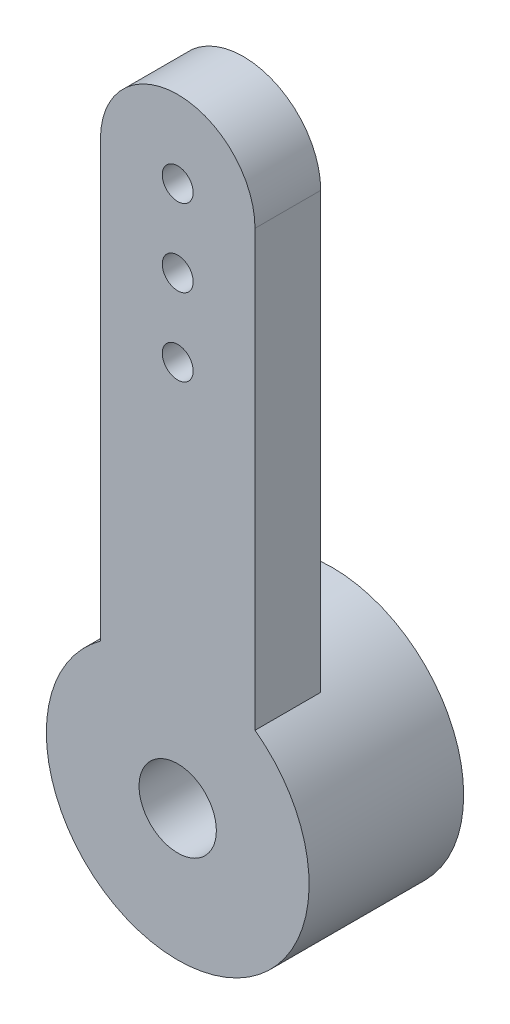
from build123d import *

# Parameters (mm, degrees)
ESQUISSE1_R        = 1
ESQUISSE1_R_2      = 0.4
BOSS_EXTRU_1_DEPTH = 1.7
BOSS_EXTRU_2_START = 2.3
ESQUISSE2_R        = 3.4
ESQUISSE2_R_2      = 2.4
BOSS_EXTRU_2_DEPTH = 2.3


with BuildPart() as part:
    # Esquisse1 → Boss.-Extru.1 (new body)
    with BuildSketch(Plane.XY):
        with BuildLine():
            Line((2, 14), (2, 2.749545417))
            ThreePointArc((2, 2.749545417), (0, -3.4), (-2, 2.749545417))
            Line((-2, 2.749545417), (-2, 14))
            ThreePointArc((-2, 14), (0, 16), (2, 14))
        make_face()
        Circle(ESQUISSE1_R, mode=Mode.SUBTRACT)
        with Locations((0, 14)):
            Circle(ESQUISSE1_R_2, mode=Mode.SUBTRACT)
        with Locations((0, 12)):
            Circle(ESQUISSE1_R_2, mode=Mode.SUBTRACT)
        with Locations((0, 10)):
            Circle(ESQUISSE1_R_2, mode=Mode.SUBTRACT)
    extrude(amount=BOSS_EXTRU_1_DEPTH)

    # Esquisse2 → Boss.-Extru.2 (add)
    with BuildSketch(Plane(origin=(0, 0, 0), x_dir=(-1, 0, 0), z_dir=(0, 0, -1)).offset(BOSS_EXTRU_2_START)):
        Circle(ESQUISSE2_R)
        Circle(ESQUISSE2_R_2, mode=Mode.SUBTRACT)
    extrude(amount=-BOSS_EXTRU_2_DEPTH)


solid = part.part
